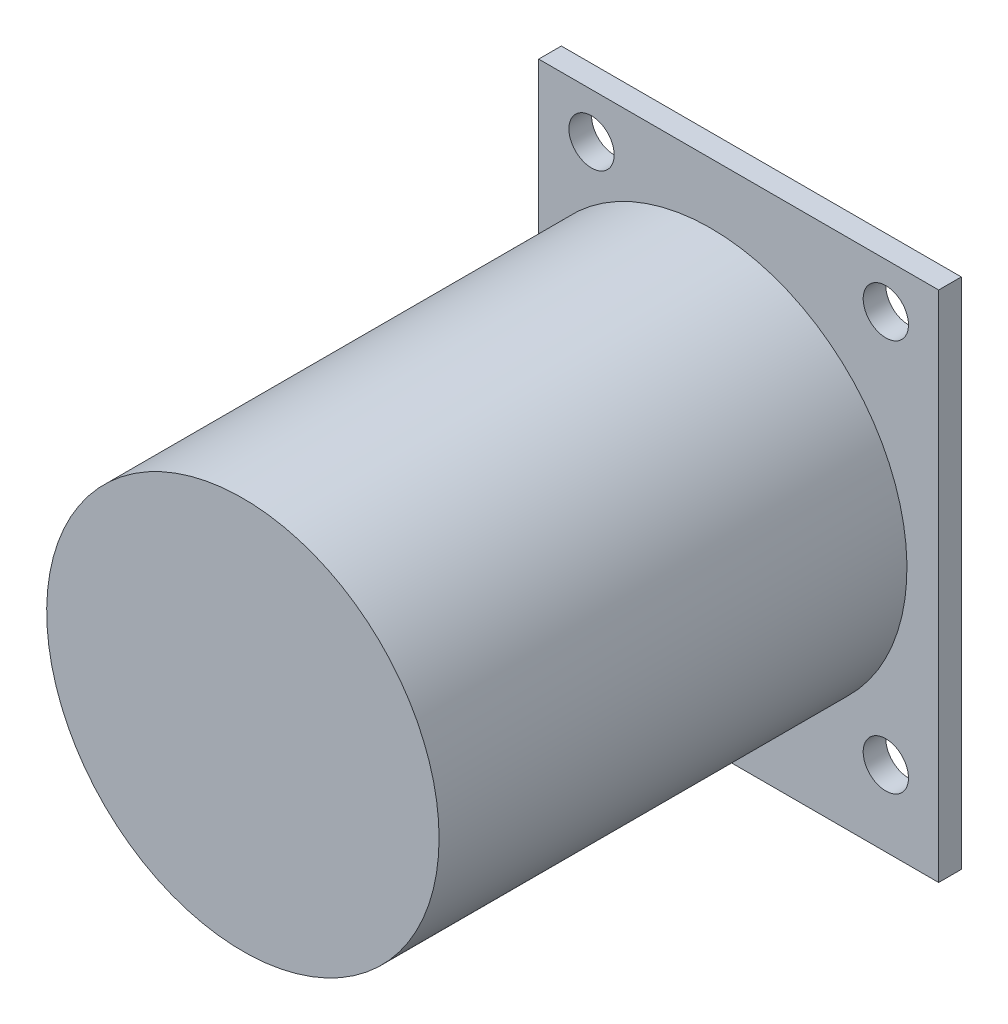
ISO-10303-21;
HEADER;
FILE_DESCRIPTION(('STEP AP214'),'2;1');
FILE_NAME('part.step','',(''),(''),'','','');
FILE_SCHEMA(('AUTOMOTIVE_DESIGN { 1 0 10303 214 1 1 1 1 }'));
ENDSEC;
DATA;
#1=APPLICATION_CONTEXT('core data for automotive mechanical design processes');
#2=APPLICATION_PROTOCOL_DEFINITION('international standard','automotive_design',2000,#1);
#3=PRODUCT_CONTEXT('',#1,'mechanical');
#4=PRODUCT('Part','Part','',(#3));
#5=PRODUCT_RELATED_PRODUCT_CATEGORY('part','',(#4));
#6=PRODUCT_DEFINITION_FORMATION('','',#4);
#7=PRODUCT_DEFINITION_CONTEXT('part definition',#1,'design');
#8=PRODUCT_DEFINITION('design','',#6,#7);
#9=PRODUCT_DEFINITION_SHAPE('','',#8);
#10=(LENGTH_UNIT() NAMED_UNIT(*) SI_UNIT(.MILLI.,.METRE.));
#11=(NAMED_UNIT(*) PLANE_ANGLE_UNIT() SI_UNIT($,.RADIAN.));
#12=(NAMED_UNIT(*) SI_UNIT($,.STERADIAN.) SOLID_ANGLE_UNIT());
#13=UNCERTAINTY_MEASURE_WITH_UNIT(LENGTH_MEASURE(1.E-05),#10,'distance_accuracy_value','');
#14=(GEOMETRIC_REPRESENTATION_CONTEXT(3) GLOBAL_UNCERTAINTY_ASSIGNED_CONTEXT((#13)) GLOBAL_UNIT_ASSIGNED_CONTEXT((#10,
#11,#12)) REPRESENTATION_CONTEXT('',''));
#15=CARTESIAN_POINT('',(0.,0.,0.));
#16=DIRECTION('',(0.,0.,1.));
#17=DIRECTION('',(1.,0.,0.));
#18=AXIS2_PLACEMENT_3D('',#15,#16,#17);
#19=CARTESIAN_POINT('',(0.,17.,-1.5));
#20=DIRECTION('',(0.,1.,0.));
#21=DIRECTION('',(0.,0.,1.));
#22=AXIS2_PLACEMENT_3D('',#19,#20,#21);
#23=PLANE('',#22);
#24=DIRECTION('',(-1.,0.,0.));
#25=VECTOR('',#24,1.);
#26=CARTESIAN_POINT('',(0.,17.,0.));
#27=LINE('',#26,#25);
#28=CARTESIAN_POINT('',(13.25,17.,0.));
#29=VERTEX_POINT('',#28);
#30=CARTESIAN_POINT('',(-13.25,17.,0.));
#31=VERTEX_POINT('',#30);
#32=EDGE_CURVE('E111',#29,#31,#27,.T.);
#33=ORIENTED_EDGE('',*,*,#32,.F.);
#34=DIRECTION('',(0.,0.,1.));
#35=VECTOR('',#34,1.);
#36=CARTESIAN_POINT('',(13.25,17.,-1.5));
#37=LINE('',#36,#35);
#38=CARTESIAN_POINT('',(13.25,17.,-1.5));
#39=VERTEX_POINT('',#38);
#40=EDGE_CURVE('E117',#39,#29,#37,.T.);
#41=ORIENTED_EDGE('',*,*,#40,.F.);
#42=DIRECTION('',(-1.,0.,0.));
#43=VECTOR('',#42,1.);
#44=CARTESIAN_POINT('',(0.,17.,-1.5));
#45=LINE('',#44,#43);
#46=CARTESIAN_POINT('',(-13.25,17.,-1.5));
#47=VERTEX_POINT('',#46);
#48=EDGE_CURVE('E126',#39,#47,#45,.T.);
#49=ORIENTED_EDGE('',*,*,#48,.T.);
#50=DIRECTION('',(0.,0.,1.));
#51=VECTOR('',#50,1.);
#52=CARTESIAN_POINT('',(-13.25,17.,-1.5));
#53=LINE('',#52,#51);
#54=EDGE_CURVE('E45',#47,#31,#53,.T.);
#55=ORIENTED_EDGE('',*,*,#54,.T.);
#56=EDGE_LOOP('',(#33,#41,#49,#55));
#57=FACE_BOUND('',#56,.T.);
#58=ADVANCED_FACE('F41',(#57),#23,.T.);
#59=CARTESIAN_POINT('',(13.25,0.,-1.5));
#60=DIRECTION('',(1.,0.,0.));
#61=DIRECTION('',(0.,0.,-1.));
#62=AXIS2_PLACEMENT_3D('',#59,#60,#61);
#63=PLANE('',#62);
#64=DIRECTION('',(0.,1.,0.));
#65=VECTOR('',#64,1.);
#66=CARTESIAN_POINT('',(13.25,0.,0.));
#67=LINE('',#66,#65);
#68=CARTESIAN_POINT('',(13.25,-17.,0.));
#69=VERTEX_POINT('',#68);
#70=EDGE_CURVE('E153',#69,#29,#67,.T.);
#71=ORIENTED_EDGE('',*,*,#70,.F.);
#72=DIRECTION('',(0.,0.,1.));
#73=VECTOR('',#72,1.);
#74=CARTESIAN_POINT('',(13.25,-17.,-1.5));
#75=LINE('',#74,#73);
#76=CARTESIAN_POINT('',(13.25,-17.,-1.5));
#77=VERTEX_POINT('',#76);
#78=EDGE_CURVE('E164',#77,#69,#75,.T.);
#79=ORIENTED_EDGE('',*,*,#78,.F.);
#80=DIRECTION('',(0.,1.,0.));
#81=VECTOR('',#80,1.);
#82=CARTESIAN_POINT('',(13.25,0.,-1.5));
#83=LINE('',#82,#81);
#84=EDGE_CURVE('E135',#77,#39,#83,.T.);
#85=ORIENTED_EDGE('',*,*,#84,.T.);
#86=ORIENTED_EDGE('',*,*,#40,.T.);
#87=EDGE_LOOP('',(#71,#79,#85,#86));
#88=FACE_BOUND('',#87,.T.);
#89=ADVANCED_FACE('F179',(#88),#63,.T.);
#90=CARTESIAN_POINT('',(0.,-17.,-1.5));
#91=DIRECTION('',(0.,1.,0.));
#92=DIRECTION('',(-1.,0.,0.));
#93=AXIS2_PLACEMENT_3D('',#90,#91,#92);
#94=PLANE('',#93);
#95=DIRECTION('',(-1.,0.,0.));
#96=VECTOR('',#95,1.);
#97=CARTESIAN_POINT('',(0.,-17.,0.));
#98=LINE('',#97,#96);
#99=CARTESIAN_POINT('',(-13.25,-17.,0.));
#100=VERTEX_POINT('',#99);
#101=EDGE_CURVE('E150',#69,#100,#98,.T.);
#102=ORIENTED_EDGE('',*,*,#101,.T.);
#103=DIRECTION('',(0.,0.,1.));
#104=VECTOR('',#103,1.);
#105=CARTESIAN_POINT('',(-13.25,-17.,-1.5));
#106=LINE('',#105,#104);
#107=CARTESIAN_POINT('',(-13.25,-17.,-1.5));
#108=VERTEX_POINT('',#107);
#109=EDGE_CURVE('E165',#108,#100,#106,.T.);
#110=ORIENTED_EDGE('',*,*,#109,.F.);
#111=DIRECTION('',(-1.,0.,0.));
#112=VECTOR('',#111,1.);
#113=CARTESIAN_POINT('',(0.,-17.,-1.5));
#114=LINE('',#113,#112);
#115=EDGE_CURVE('E132',#77,#108,#114,.T.);
#116=ORIENTED_EDGE('',*,*,#115,.F.);
#117=ORIENTED_EDGE('',*,*,#78,.T.);
#118=EDGE_LOOP('',(#102,#110,#116,#117));
#119=FACE_BOUND('',#118,.T.);
#120=ADVANCED_FACE('F175',(#119),#94,.F.);
#121=CARTESIAN_POINT('',(9.75,14.,-1.5));
#122=DIRECTION('',(0.,0.,1.));
#123=DIRECTION('',(1.,0.,0.));
#124=AXIS2_PLACEMENT_3D('',#121,#122,#123);
#125=CYLINDRICAL_SURFACE('',#124,1.5);
#126=CARTESIAN_POINT('',(9.75,14.,-1.5));
#127=DIRECTION('',(0.,0.,1.));
#128=DIRECTION('',(1.,0.,0.));
#129=AXIS2_PLACEMENT_3D('',#126,#127,#128);
#130=CIRCLE('',#129,1.5);
#131=CARTESIAN_POINT('',(11.25,14.,-1.5));
#132=VERTEX_POINT('',#131);
#133=EDGE_CURVE('E141',#132,#132,#130,.T.);
#134=ORIENTED_EDGE('',*,*,#133,.F.);
#135=EDGE_LOOP('',(#134));
#136=FACE_BOUND('',#135,.T.);
#137=CARTESIAN_POINT('',(9.75,14.,0.));
#138=DIRECTION('',(0.,0.,1.));
#139=DIRECTION('',(1.,0.,0.));
#140=AXIS2_PLACEMENT_3D('',#137,#138,#139);
#141=CIRCLE('',#140,1.5);
#142=CARTESIAN_POINT('',(11.25,14.,0.));
#143=VERTEX_POINT('',#142);
#144=EDGE_CURVE('E158',#143,#143,#141,.T.);
#145=ORIENTED_EDGE('',*,*,#144,.T.);
#146=EDGE_LOOP('',(#145));
#147=FACE_BOUND('',#146,.T.);
#148=ADVANCED_FACE('F186',(#136,#147),#125,.F.);
#149=CARTESIAN_POINT('',(9.75,-12.,-1.5));
#150=DIRECTION('',(0.,0.,1.));
#151=DIRECTION('',(1.,0.,0.));
#152=AXIS2_PLACEMENT_3D('',#149,#150,#151);
#153=CYLINDRICAL_SURFACE('',#152,1.5);
#154=CARTESIAN_POINT('',(9.75,-12.,-1.5));
#155=DIRECTION('',(0.,0.,1.));
#156=DIRECTION('',(1.,0.,0.));
#157=AXIS2_PLACEMENT_3D('',#154,#155,#156);
#158=CIRCLE('',#157,1.5);
#159=CARTESIAN_POINT('',(11.25,-12.,-1.5));
#160=VERTEX_POINT('',#159);
#161=EDGE_CURVE('E138',#160,#160,#158,.T.);
#162=ORIENTED_EDGE('',*,*,#161,.F.);
#163=EDGE_LOOP('',(#162));
#164=FACE_BOUND('',#163,.T.);
#165=CARTESIAN_POINT('',(9.75,-12.,0.));
#166=DIRECTION('',(0.,0.,1.));
#167=DIRECTION('',(1.,0.,0.));
#168=AXIS2_PLACEMENT_3D('',#165,#166,#167);
#169=CIRCLE('',#168,1.5);
#170=CARTESIAN_POINT('',(11.25,-12.,0.));
#171=VERTEX_POINT('',#170);
#172=EDGE_CURVE('E155',#171,#171,#169,.T.);
#173=ORIENTED_EDGE('',*,*,#172,.T.);
#174=EDGE_LOOP('',(#173));
#175=FACE_BOUND('',#174,.T.);
#176=ADVANCED_FACE('F189',(#164,#175),#153,.F.);
#177=CARTESIAN_POINT('',(-13.25,0.,-1.5));
#178=DIRECTION('',(1.,0.,0.));
#179=DIRECTION('',(0.,0.,-1.));
#180=AXIS2_PLACEMENT_3D('',#177,#178,#179);
#181=PLANE('',#180);
#182=DIRECTION('',(0.,1.,0.));
#183=VECTOR('',#182,1.);
#184=CARTESIAN_POINT('',(-13.25,0.,0.));
#185=LINE('',#184,#183);
#186=CARTESIAN_POINT('',(-13.25,-6.24819974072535,0.));
#187=VERTEX_POINT('',#186);
#188=EDGE_CURVE('E100',#100,#187,#185,.T.);
#189=ORIENTED_EDGE('',*,*,#188,.T.);
#190=CARTESIAN_POINT('',(-13.25,6.24819974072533,0.));
#191=VERTEX_POINT('',#190);
#192=EDGE_CURVE('E93',#187,#191,#185,.T.);
#193=ORIENTED_EDGE('',*,*,#192,.T.);
#194=EDGE_CURVE('E97',#191,#31,#185,.T.);
#195=ORIENTED_EDGE('',*,*,#194,.T.);
#196=ORIENTED_EDGE('',*,*,#54,.F.);
#197=DIRECTION('',(0.,1.,0.));
#198=VECTOR('',#197,1.);
#199=CARTESIAN_POINT('',(-13.25,0.,-1.5));
#200=LINE('',#199,#198);
#201=EDGE_CURVE('E130',#108,#47,#200,.T.);
#202=ORIENTED_EDGE('',*,*,#201,.F.);
#203=ORIENTED_EDGE('',*,*,#109,.T.);
#204=EDGE_LOOP('',(#189,#193,#195,#196,#202,#203));
#205=FACE_BOUND('',#204,.T.);
#206=ADVANCED_FACE('F95',(#205),#181,.F.);
#207=CARTESIAN_POINT('',(-9.75,-12.,-1.5));
#208=DIRECTION('',(0.,0.,1.));
#209=DIRECTION('',(1.,0.,0.));
#210=AXIS2_PLACEMENT_3D('',#207,#208,#209);
#211=CYLINDRICAL_SURFACE('',#210,1.5);
#212=CARTESIAN_POINT('',(-9.75,-12.,-1.5));
#213=DIRECTION('',(0.,0.,1.));
#214=DIRECTION('',(1.,0.,0.));
#215=AXIS2_PLACEMENT_3D('',#212,#213,#214);
#216=CIRCLE('',#215,1.5);
#217=CARTESIAN_POINT('',(-8.25,-12.,-1.5));
#218=VERTEX_POINT('',#217);
#219=EDGE_CURVE('E123',#218,#218,#216,.T.);
#220=ORIENTED_EDGE('',*,*,#219,.F.);
#221=EDGE_LOOP('',(#220));
#222=FACE_BOUND('',#221,.T.);
#223=CARTESIAN_POINT('',(-9.75,-12.,0.));
#224=DIRECTION('',(0.,0.,1.));
#225=DIRECTION('',(1.,0.,0.));
#226=AXIS2_PLACEMENT_3D('',#223,#224,#225);
#227=CIRCLE('',#226,1.5);
#228=CARTESIAN_POINT('',(-8.5005035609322,-11.1700851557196,0.));
#229=VERTEX_POINT('',#228);
#230=CARTESIAN_POINT('',(-9.48157579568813,-10.524212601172,0.));
#231=VERTEX_POINT('',#230);
#232=EDGE_CURVE('E147',#229,#231,#227,.T.);
#233=ORIENTED_EDGE('',*,*,#232,.T.);
#234=EDGE_CURVE('E62',#231,#229,#227,.T.);
#235=ORIENTED_EDGE('',*,*,#234,.T.);
#236=EDGE_LOOP('',(#233,#235));
#237=FACE_BOUND('',#236,.T.);
#238=ADVANCED_FACE('F43',(#222,#237),#211,.F.);
#239=CARTESIAN_POINT('',(-9.75,14.,-1.5));
#240=DIRECTION('',(0.,0.,1.));
#241=DIRECTION('',(1.,0.,0.));
#242=AXIS2_PLACEMENT_3D('',#239,#240,#241);
#243=CYLINDRICAL_SURFACE('',#242,1.5);
#244=CARTESIAN_POINT('',(-9.75,14.,-1.5));
#245=DIRECTION('',(0.,0.,1.));
#246=DIRECTION('',(1.,0.,0.));
#247=AXIS2_PLACEMENT_3D('',#244,#245,#246);
#248=CIRCLE('',#247,1.5);
#249=CARTESIAN_POINT('',(-8.25,14.,-1.5));
#250=VERTEX_POINT('',#249);
#251=EDGE_CURVE('E144',#250,#250,#248,.T.);
#252=ORIENTED_EDGE('',*,*,#251,.F.);
#253=EDGE_LOOP('',(#252));
#254=FACE_BOUND('',#253,.T.);
#255=CARTESIAN_POINT('',(-9.75,14.,0.));
#256=DIRECTION('',(0.,0.,1.));
#257=DIRECTION('',(1.,0.,0.));
#258=AXIS2_PLACEMENT_3D('',#255,#256,#257);
#259=CIRCLE('',#258,1.5);
#260=CARTESIAN_POINT('',(-8.25,14.,0.));
#261=VERTEX_POINT('',#260);
#262=EDGE_CURVE('E127',#261,#261,#259,.T.);
#263=ORIENTED_EDGE('',*,*,#262,.T.);
#264=EDGE_LOOP('',(#263));
#265=FACE_BOUND('',#264,.T.);
#266=ADVANCED_FACE('F197',(#254,#265),#243,.F.);
#267=CARTESIAN_POINT('',(0.,0.,-1.5));
#268=DIRECTION('',(0.,0.,1.));
#269=DIRECTION('',(1.,0.,0.));
#270=AXIS2_PLACEMENT_3D('',#267,#268,#269);
#271=PLANE('',#270);
#272=ORIENTED_EDGE('',*,*,#219,.T.);
#273=EDGE_LOOP('',(#272));
#274=FACE_BOUND('',#273,.T.);
#275=ORIENTED_EDGE('',*,*,#48,.F.);
#276=ORIENTED_EDGE('',*,*,#84,.F.);
#277=ORIENTED_EDGE('',*,*,#115,.T.);
#278=ORIENTED_EDGE('',*,*,#201,.T.);
#279=EDGE_LOOP('',(#275,#276,#277,#278));
#280=FACE_BOUND('',#279,.T.);
#281=ORIENTED_EDGE('',*,*,#161,.T.);
#282=EDGE_LOOP('',(#281));
#283=FACE_BOUND('',#282,.T.);
#284=ORIENTED_EDGE('',*,*,#133,.T.);
#285=EDGE_LOOP('',(#284));
#286=FACE_BOUND('',#285,.T.);
#287=ORIENTED_EDGE('',*,*,#251,.T.);
#288=EDGE_LOOP('',(#287));
#289=FACE_BOUND('',#288,.T.);
#290=ADVANCED_FACE('F172',(#274,#280,#283,#286,#289),#271,.F.);
#291=CARTESIAN_POINT('',(0.,0.,0.));
#292=DIRECTION('',(0.,0.,1.));
#293=DIRECTION('',(1.,0.,0.));
#294=AXIS2_PLACEMENT_3D('',#291,#292,#293);
#295=PLANE('',#294);
#296=CARTESIAN_POINT('',(-1.85,0.,0.));
#297=DIRECTION('',(0.,0.,1.));
#298=DIRECTION('',(1.,0.,0.));
#299=AXIS2_PLACEMENT_3D('',#296,#297,#298);
#300=CIRCLE('',#299,13.);
#301=EDGE_CURVE('E11',#187,#231,#300,.T.);
#302=ORIENTED_EDGE('',*,*,#301,.F.);
#303=ORIENTED_EDGE('',*,*,#188,.F.);
#304=ORIENTED_EDGE('',*,*,#101,.F.);
#305=ORIENTED_EDGE('',*,*,#70,.T.);
#306=ORIENTED_EDGE('',*,*,#32,.T.);
#307=ORIENTED_EDGE('',*,*,#194,.F.);
#308=EDGE_CURVE('E50',#229,#191,#300,.T.);
#309=ORIENTED_EDGE('',*,*,#308,.F.);
#310=ORIENTED_EDGE('',*,*,#234,.F.);
#311=EDGE_LOOP('',(#302,#303,#304,#305,#306,#307,#309,#310));
#312=FACE_BOUND('',#311,.T.);
#313=ORIENTED_EDGE('',*,*,#172,.F.);
#314=EDGE_LOOP('',(#313));
#315=FACE_BOUND('',#314,.T.);
#316=ORIENTED_EDGE('',*,*,#144,.F.);
#317=EDGE_LOOP('',(#316));
#318=FACE_BOUND('',#317,.T.);
#319=ORIENTED_EDGE('',*,*,#262,.F.);
#320=EDGE_LOOP('',(#319));
#321=FACE_BOUND('',#320,.T.);
#322=ADVANCED_FACE('F107',(#312,#315,#318,#321),#295,.T.);
#323=CARTESIAN_POINT('',(0.,0.,0.));
#324=DIRECTION('',(0.,0.,1.));
#325=DIRECTION('',(1.,0.,0.));
#326=AXIS2_PLACEMENT_3D('',#323,#324,#325);
#327=PLANE('',#326);
#328=ORIENTED_EDGE('',*,*,#232,.F.);
#329=EDGE_CURVE('E52',#231,#229,#300,.T.);
#330=ORIENTED_EDGE('',*,*,#329,.F.);
#331=EDGE_LOOP('',(#328,#330));
#332=FACE_BOUND('',#331,.T.);
#333=ADVANCED_FACE('F209',(#332),#327,.F.);
#334=CARTESIAN_POINT('',(-1.85,0.,31.));
#335=DIRECTION('',(0.,0.,-1.));
#336=DIRECTION('',(-1.,0.,0.));
#337=AXIS2_PLACEMENT_3D('',#334,#335,#336);
#338=CYLINDRICAL_SURFACE('',#337,13.);
#339=CARTESIAN_POINT('',(-1.85,0.,31.));
#340=DIRECTION('',(0.,0.,1.));
#341=DIRECTION('',(1.,0.,0.));
#342=AXIS2_PLACEMENT_3D('',#339,#340,#341);
#343=CIRCLE('',#342,13.);
#344=CARTESIAN_POINT('',(11.15,0.,31.));
#345=VERTEX_POINT('',#344);
#346=EDGE_CURVE('E119',#345,#345,#343,.T.);
#347=ORIENTED_EDGE('',*,*,#346,.F.);
#348=EDGE_LOOP('',(#347));
#349=FACE_BOUND('',#348,.T.);
#350=EDGE_CURVE('E115',#191,#187,#300,.T.);
#351=ORIENTED_EDGE('',*,*,#350,.T.);
#352=ORIENTED_EDGE('',*,*,#301,.T.);
#353=ORIENTED_EDGE('',*,*,#329,.T.);
#354=ORIENTED_EDGE('',*,*,#308,.T.);
#355=EDGE_LOOP('',(#351,#352,#353,#354));
#356=FACE_BOUND('',#355,.T.);
#357=ADVANCED_FACE('F114',(#349,#356),#338,.T.);
#358=CARTESIAN_POINT('',(0.,0.,31.));
#359=DIRECTION('',(0.,0.,1.));
#360=DIRECTION('',(1.,0.,0.));
#361=AXIS2_PLACEMENT_3D('',#358,#359,#360);
#362=PLANE('',#361);
#363=ORIENTED_EDGE('',*,*,#346,.T.);
#364=EDGE_LOOP('',(#363));
#365=FACE_BOUND('',#364,.T.);
#366=ADVANCED_FACE('F227',(#365),#362,.T.);
#367=ORIENTED_EDGE('',*,*,#192,.F.);
#368=ORIENTED_EDGE('',*,*,#350,.F.);
#369=EDGE_LOOP('',(#367,#368));
#370=FACE_BOUND('',#369,.T.);
#371=ADVANCED_FACE('F118',(#370),#327,.F.);
#372=CLOSED_SHELL('',(#58,#89,#120,#148,#176,#206,#238,#266,#290,#322,#333,#357,#366,#371));
#373=MANIFOLD_SOLID_BREP('B2',#372);
#374=ADVANCED_BREP_SHAPE_REPRESENTATION('',(#18,#373),#14);
#375=SHAPE_DEFINITION_REPRESENTATION(#9,#374);
ENDSEC;
END-ISO-10303-21;
